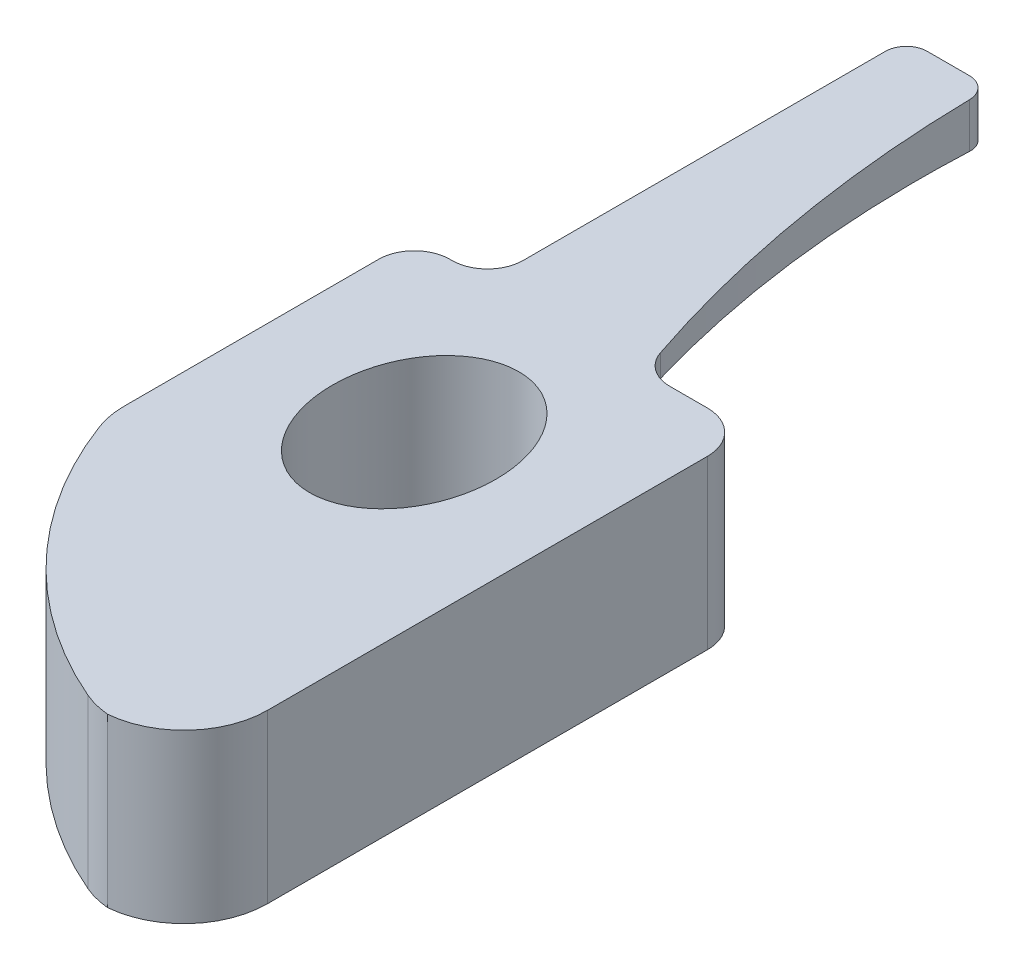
ISO-10303-21;
HEADER;
FILE_DESCRIPTION(('STEP AP214'),'2;1');
FILE_NAME('part.step','',(''),(''),'','','');
FILE_SCHEMA(('AUTOMOTIVE_DESIGN { 1 0 10303 214 1 1 1 1 }'));
ENDSEC;
DATA;
#1=APPLICATION_CONTEXT('core data for automotive mechanical design processes');
#2=APPLICATION_PROTOCOL_DEFINITION('international standard','automotive_design',2000,#1);
#3=PRODUCT_CONTEXT('',#1,'mechanical');
#4=PRODUCT('Part','Part','',(#3));
#5=PRODUCT_RELATED_PRODUCT_CATEGORY('part','',(#4));
#6=PRODUCT_DEFINITION_FORMATION('','',#4);
#7=PRODUCT_DEFINITION_CONTEXT('part definition',#1,'design');
#8=PRODUCT_DEFINITION('design','',#6,#7);
#9=PRODUCT_DEFINITION_SHAPE('','',#8);
#10=(LENGTH_UNIT() NAMED_UNIT(*) SI_UNIT(.MILLI.,.METRE.));
#11=(NAMED_UNIT(*) PLANE_ANGLE_UNIT() SI_UNIT($,.RADIAN.));
#12=(NAMED_UNIT(*) SI_UNIT($,.STERADIAN.) SOLID_ANGLE_UNIT());
#13=UNCERTAINTY_MEASURE_WITH_UNIT(LENGTH_MEASURE(1.E-05),#10,'distance_accuracy_value','');
#14=(GEOMETRIC_REPRESENTATION_CONTEXT(3) GLOBAL_UNCERTAINTY_ASSIGNED_CONTEXT((#13)) GLOBAL_UNIT_ASSIGNED_CONTEXT((#10,
#11,#12)) REPRESENTATION_CONTEXT('',''));
#15=CARTESIAN_POINT('',(0.,0.,0.));
#16=DIRECTION('',(0.,0.,1.));
#17=DIRECTION('',(1.,0.,0.));
#18=AXIS2_PLACEMENT_3D('',#15,#16,#17);
#19=CARTESIAN_POINT('',(-4.,4.,-4.));
#20=DIRECTION('',(0.,0.,1.));
#21=DIRECTION('',(1.,0.,0.));
#22=AXIS2_PLACEMENT_3D('',#19,#20,#21);
#23=PLANE('',#22);
#24=DIRECTION('',(1.,0.,0.));
#25=VECTOR('',#24,1.);
#26=CARTESIAN_POINT('',(4.,4.,-4.));
#27=LINE('',#26,#25);
#28=CARTESIAN_POINT('',(2.10338099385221,4.,-4.));
#29=VERTEX_POINT('',#28);
#30=CARTESIAN_POINT('',(3.,4.,-4.));
#31=VERTEX_POINT('',#30);
#32=EDGE_CURVE('E430',#29,#31,#27,.T.);
#33=ORIENTED_EDGE('',*,*,#32,.T.);
#34=DIRECTION('',(0.,-1.,0.));
#35=VECTOR('',#34,1.);
#36=CARTESIAN_POINT('',(3.,4.,-4.));
#37=LINE('',#36,#35);
#38=CARTESIAN_POINT('',(3.,0.,-4.));
#39=VERTEX_POINT('',#38);
#40=EDGE_CURVE('E292',#31,#39,#37,.T.);
#41=ORIENTED_EDGE('',*,*,#40,.T.);
#42=DIRECTION('',(-1.,0.,0.));
#43=VECTOR('',#42,1.);
#44=CARTESIAN_POINT('',(-4.,0.,-4.));
#45=LINE('',#44,#43);
#46=CARTESIAN_POINT('',(-3.15,0.,-4.));
#47=VERTEX_POINT('',#46);
#48=EDGE_CURVE('E383',#39,#47,#45,.T.);
#49=ORIENTED_EDGE('',*,*,#48,.T.);
#50=DIRECTION('',(0.,-1.,0.));
#51=VECTOR('',#50,1.);
#52=CARTESIAN_POINT('',(-3.15,4.,-4.));
#53=LINE('',#52,#51);
#54=CARTESIAN_POINT('',(-3.15,4.,-4.));
#55=VERTEX_POINT('',#54);
#56=EDGE_CURVE('E241',#47,#55,#53,.F.);
#57=ORIENTED_EDGE('',*,*,#56,.T.);
#58=DIRECTION('',(1.,0.,0.));
#59=VECTOR('',#58,1.);
#60=CARTESIAN_POINT('',(-4.,4.,-4.));
#61=LINE('',#60,#59);
#62=CARTESIAN_POINT('',(-3.1,4.,-4.));
#63=VERTEX_POINT('',#62);
#64=EDGE_CURVE('E444',#55,#63,#61,.T.);
#65=ORIENTED_EDGE('',*,*,#64,.T.);
#66=DIRECTION('',(0.,1.,0.));
#67=VECTOR('',#66,1.);
#68=CARTESIAN_POINT('',(-3.1,2.96910080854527,-4.));
#69=LINE('',#68,#67);
#70=CARTESIAN_POINT('',(-3.1,2.96910080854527,-4.));
#71=VERTEX_POINT('',#70);
#72=EDGE_CURVE('E237',#63,#71,#69,.F.);
#73=ORIENTED_EDGE('',*,*,#72,.T.);
#74=DIRECTION('',(-1.,0.,0.));
#75=VECTOR('',#74,1.);
#76=CARTESIAN_POINT('',(-4.,2.96910080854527,-4.));
#77=LINE('',#76,#75);
#78=CARTESIAN_POINT('',(2.10338099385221,2.96910080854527,-4.));
#79=VERTEX_POINT('',#78);
#80=EDGE_CURVE('E204',#71,#79,#77,.F.);
#81=ORIENTED_EDGE('',*,*,#80,.T.);
#82=DIRECTION('',(0.,-1.,0.));
#83=VECTOR('',#82,1.);
#84=CARTESIAN_POINT('',(2.10338099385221,4.,-4.));
#85=LINE('',#84,#83);
#86=EDGE_CURVE('E233',#79,#29,#85,.F.);
#87=ORIENTED_EDGE('',*,*,#86,.T.);
#88=EDGE_LOOP('',(#33,#41,#49,#57,#65,#73,#81,#87));
#89=FACE_BOUND('',#88,.T.);
#90=ADVANCED_FACE('F45',(#89),#23,.F.);
#91=CARTESIAN_POINT('',(5.5,4.,0.15));
#92=DIRECTION('',(0.,1.,0.));
#93=DIRECTION('',(0.,0.,1.));
#94=AXIS2_PLACEMENT_3D('',#91,#92,#93);
#95=PLANE('',#94);
#96=DIRECTION('',(0.,0.,1.));
#97=VECTOR('',#96,1.);
#98=CARTESIAN_POINT('',(-4.,4.,-4.));
#99=LINE('',#98,#97);
#100=CARTESIAN_POINT('',(-4.,4.,-3.15));
#101=VERTEX_POINT('',#100);
#102=CARTESIAN_POINT('',(-4.,4.,2.93388218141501));
#103=VERTEX_POINT('',#102);
#104=EDGE_CURVE('E348',#101,#103,#99,.T.);
#105=ORIENTED_EDGE('',*,*,#104,.T.);
#106=CARTESIAN_POINT('',(-2.,4.,2.93388218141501));
#107=DIRECTION('',(0.,1.,0.));
#108=DIRECTION('',(0.,0.,1.));
#109=AXIS2_PLACEMENT_3D('',#106,#107,#108);
#110=CIRCLE('',#109,2.);
#111=CARTESIAN_POINT('',(-3.875,4.,3.62985272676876));
#112=VERTEX_POINT('',#111);
#113=EDGE_CURVE('E55',#103,#112,#110,.T.);
#114=ORIENTED_EDGE('',*,*,#113,.T.);
#115=CARTESIAN_POINT('',(5.5,4.,0.15));
#116=DIRECTION('',(0.,1.,0.));
#117=DIRECTION('',(0.,0.,1.));
#118=AXIS2_PLACEMENT_3D('',#115,#116,#117);
#119=CIRCLE('',#118,10.);
#120=CARTESIAN_POINT('',(1.55160238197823,4.,9.3375));
#121=VERTEX_POINT('',#120);
#122=EDGE_CURVE('E339',#112,#121,#119,.T.);
#123=ORIENTED_EDGE('',*,*,#122,.T.);
#124=CARTESIAN_POINT('',(2.34128190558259,4.,7.5));
#125=DIRECTION('',(0.,1.,0.));
#126=DIRECTION('',(0.,0.,1.));
#127=AXIS2_PLACEMENT_3D('',#124,#125,#126);
#128=CIRCLE('',#127,2.);
#129=CARTESIAN_POINT('',(2.17064095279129,4.,9.49270711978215));
#130=VERTEX_POINT('',#129);
#131=EDGE_CURVE('E62',#121,#130,#128,.T.);
#132=ORIENTED_EDGE('',*,*,#131,.T.);
#133=CARTESIAN_POINT('',(2.,4.,7.5));
#134=DIRECTION('',(0.,1.,0.));
#135=DIRECTION('',(0.,0.,1.));
#136=AXIS2_PLACEMENT_3D('',#133,#134,#135);
#137=CIRCLE('',#136,2.);
#138=CARTESIAN_POINT('',(4.,4.,7.5));
#139=VERTEX_POINT('',#138);
#140=EDGE_CURVE('E67',#130,#139,#137,.T.);
#141=ORIENTED_EDGE('',*,*,#140,.T.);
#142=DIRECTION('',(0.,0.,-1.));
#143=VECTOR('',#142,1.);
#144=CARTESIAN_POINT('',(4.,4.,-4.));
#145=LINE('',#144,#143);
#146=CARTESIAN_POINT('',(4.,4.,-3.));
#147=VERTEX_POINT('',#146);
#148=EDGE_CURVE('E347',#139,#147,#145,.T.);
#149=ORIENTED_EDGE('',*,*,#148,.T.);
#150=CARTESIAN_POINT('',(3.,4.,-3.));
#151=DIRECTION('',(0.,1.,0.));
#152=DIRECTION('',(0.,0.,1.));
#153=AXIS2_PLACEMENT_3D('',#150,#151,#152);
#154=CIRCLE('',#153,1.);
#155=EDGE_CURVE('E360',#147,#31,#154,.T.);
#156=ORIENTED_EDGE('',*,*,#155,.T.);
#157=ORIENTED_EDGE('',*,*,#32,.F.);
#158=CARTESIAN_POINT('',(2.10338099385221,4.,-4.85));
#159=DIRECTION('',(0.,1.,0.));
#160=DIRECTION('',(0.,0.,1.));
#161=AXIS2_PLACEMENT_3D('',#158,#159,#160);
#162=CIRCLE('',#161,0.85);
#163=CARTESIAN_POINT('',(1.29806747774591,4.,-4.57802547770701));
#164=VERTEX_POINT('',#163);
#165=EDGE_CURVE('E415',#29,#164,#162,.F.);
#166=ORIENTED_EDGE('',*,*,#165,.T.);
#167=CARTESIAN_POINT('',(29.1964285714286,4.,-14.));
#168=DIRECTION('',(0.,1.,0.));
#169=DIRECTION('',(0.,0.,1.));
#170=AXIS2_PLACEMENT_3D('',#167,#168,#169);
#171=CIRCLE('',#170,29.4464285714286);
#172=CARTESIAN_POINT('',(-0.245895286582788,4.,-13.5083482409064));
#173=VERTEX_POINT('',#172);
#174=EDGE_CURVE('E436',#173,#164,#171,.T.);
#175=ORIENTED_EDGE('',*,*,#174,.F.);
#176=CARTESIAN_POINT('',(-0.745825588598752,4.,-13.5));
#177=DIRECTION('',(0.,1.,0.));
#178=DIRECTION('',(0.,0.,1.));
#179=AXIS2_PLACEMENT_3D('',#176,#177,#178);
#180=CIRCLE('',#179,0.5);
#181=CARTESIAN_POINT('',(-0.745825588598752,4.,-14.));
#182=VERTEX_POINT('',#181);
#183=EDGE_CURVE('E201',#173,#182,#180,.T.);
#184=ORIENTED_EDGE('',*,*,#183,.T.);
#185=DIRECTION('',(-1.,0.,0.));
#186=VECTOR('',#185,1.);
#187=CARTESIAN_POINT('',(14.0603180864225,4.,-14.));
#188=LINE('',#187,#186);
#189=CARTESIAN_POINT('',(-1.75,4.,-14.));
#190=VERTEX_POINT('',#189);
#191=EDGE_CURVE('E185',#182,#190,#188,.T.);
#192=ORIENTED_EDGE('',*,*,#191,.T.);
#193=CARTESIAN_POINT('',(-1.75,4.,-13.5));
#194=DIRECTION('',(0.,1.,0.));
#195=DIRECTION('',(0.,0.,1.));
#196=AXIS2_PLACEMENT_3D('',#193,#194,#195);
#197=CIRCLE('',#196,0.5);
#198=CARTESIAN_POINT('',(-2.25,4.,-13.5));
#199=VERTEX_POINT('',#198);
#200=EDGE_CURVE('E203',#190,#199,#197,.T.);
#201=ORIENTED_EDGE('',*,*,#200,.T.);
#202=DIRECTION('',(0.,0.,-1.));
#203=VECTOR('',#202,1.);
#204=CARTESIAN_POINT('',(-2.25,4.,-14.));
#205=LINE('',#204,#203);
#206=CARTESIAN_POINT('',(-2.25,4.,-4.85));
#207=VERTEX_POINT('',#206);
#208=EDGE_CURVE('E448',#207,#199,#205,.T.);
#209=ORIENTED_EDGE('',*,*,#208,.F.);
#210=CARTESIAN_POINT('',(-3.1,4.,-4.85));
#211=DIRECTION('',(0.,1.,0.));
#212=DIRECTION('',(0.,0.,1.));
#213=AXIS2_PLACEMENT_3D('',#210,#211,#212);
#214=CIRCLE('',#213,0.85);
#215=EDGE_CURVE('E253',#207,#63,#214,.F.);
#216=ORIENTED_EDGE('',*,*,#215,.T.);
#217=ORIENTED_EDGE('',*,*,#64,.F.);
#218=CARTESIAN_POINT('',(-3.15,4.,-3.15));
#219=DIRECTION('',(0.,1.,0.));
#220=DIRECTION('',(0.,0.,1.));
#221=AXIS2_PLACEMENT_3D('',#218,#219,#220);
#222=CIRCLE('',#221,0.85);
#223=EDGE_CURVE('E244',#55,#101,#222,.T.);
#224=ORIENTED_EDGE('',*,*,#223,.T.);
#225=EDGE_LOOP('',(#105,#114,#123,#132,#141,#149,#156,#157,#166,#175,#184,#192,#201,#209,#216,
#217,#224));
#226=FACE_BOUND('',#225,.T.);
#227=CARTESIAN_POINT('',(0.,4.,0.));
#228=DIRECTION('',(0.,1.,0.));
#229=DIRECTION('',(0.,0.,1.));
#230=AXIS2_PLACEMENT_3D('',#227,#228,#229);
#231=ELLIPSE('',#230,2.5,1.95);
#232=CARTESIAN_POINT('',(0.,4.,2.5));
#233=VERTEX_POINT('',#232);
#234=EDGE_CURVE('E399',#233,#233,#231,.T.);
#235=ORIENTED_EDGE('',*,*,#234,.F.);
#236=EDGE_LOOP('',(#235));
#237=FACE_BOUND('',#236,.T.);
#238=ADVANCED_FACE('F315',(#226,#237),#95,.T.);
#239=CARTESIAN_POINT('',(5.5,0.,0.15));
#240=DIRECTION('',(0.,1.,0.));
#241=DIRECTION('',(0.,0.,1.));
#242=AXIS2_PLACEMENT_3D('',#239,#240,#241);
#243=PLANE('',#242);
#244=CARTESIAN_POINT('',(5.5,0.,0.15));
#245=DIRECTION('',(0.,1.,0.));
#246=DIRECTION('',(0.,0.,1.));
#247=AXIS2_PLACEMENT_3D('',#244,#245,#246);
#248=CIRCLE('',#247,10.);
#249=CARTESIAN_POINT('',(-3.875,0.,3.62985272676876));
#250=VERTEX_POINT('',#249);
#251=CARTESIAN_POINT('',(1.55160238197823,0.,9.3375));
#252=VERTEX_POINT('',#251);
#253=EDGE_CURVE('E398',#250,#252,#248,.T.);
#254=ORIENTED_EDGE('',*,*,#253,.F.);
#255=CARTESIAN_POINT('',(-2.,0.,2.93388218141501));
#256=DIRECTION('',(0.,1.,0.));
#257=DIRECTION('',(0.,0.,1.));
#258=AXIS2_PLACEMENT_3D('',#255,#256,#257);
#259=CIRCLE('',#258,2.);
#260=CARTESIAN_POINT('',(-4.,0.,2.93388218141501));
#261=VERTEX_POINT('',#260);
#262=EDGE_CURVE('E352',#250,#261,#259,.F.);
#263=ORIENTED_EDGE('',*,*,#262,.T.);
#264=DIRECTION('',(0.,0.,1.));
#265=VECTOR('',#264,1.);
#266=CARTESIAN_POINT('',(-4.,0.,-4.));
#267=LINE('',#266,#265);
#268=CARTESIAN_POINT('',(-4.,0.,-3.15));
#269=VERTEX_POINT('',#268);
#270=EDGE_CURVE('E394',#269,#261,#267,.T.);
#271=ORIENTED_EDGE('',*,*,#270,.F.);
#272=CARTESIAN_POINT('',(-3.15,0.,-3.15));
#273=DIRECTION('',(0.,1.,0.));
#274=DIRECTION('',(0.,0.,1.));
#275=AXIS2_PLACEMENT_3D('',#272,#273,#274);
#276=CIRCLE('',#275,0.85);
#277=EDGE_CURVE('E229',#269,#47,#276,.F.);
#278=ORIENTED_EDGE('',*,*,#277,.T.);
#279=ORIENTED_EDGE('',*,*,#48,.F.);
#280=CARTESIAN_POINT('',(3.,0.,-3.));
#281=DIRECTION('',(0.,1.,0.));
#282=DIRECTION('',(0.,0.,1.));
#283=AXIS2_PLACEMENT_3D('',#280,#281,#282);
#284=CIRCLE('',#283,1.);
#285=CARTESIAN_POINT('',(4.,0.,-3.));
#286=VERTEX_POINT('',#285);
#287=EDGE_CURVE('E422',#39,#286,#284,.F.);
#288=ORIENTED_EDGE('',*,*,#287,.T.);
#289=DIRECTION('',(0.,0.,-1.));
#290=VECTOR('',#289,1.);
#291=CARTESIAN_POINT('',(4.,0.,-4.));
#292=LINE('',#291,#290);
#293=CARTESIAN_POINT('',(4.,0.,7.5));
#294=VERTEX_POINT('',#293);
#295=EDGE_CURVE('E386',#294,#286,#292,.T.);
#296=ORIENTED_EDGE('',*,*,#295,.F.);
#297=CARTESIAN_POINT('',(2.,0.,7.5));
#298=DIRECTION('',(0.,1.,0.));
#299=DIRECTION('',(0.,0.,1.));
#300=AXIS2_PLACEMENT_3D('',#297,#298,#299);
#301=CIRCLE('',#300,2.);
#302=CARTESIAN_POINT('',(2.17064095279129,0.,9.49270711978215));
#303=VERTEX_POINT('',#302);
#304=EDGE_CURVE('E358',#294,#303,#301,.F.);
#305=ORIENTED_EDGE('',*,*,#304,.T.);
#306=CARTESIAN_POINT('',(2.34128190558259,0.,7.5));
#307=DIRECTION('',(0.,1.,0.));
#308=DIRECTION('',(0.,0.,1.));
#309=AXIS2_PLACEMENT_3D('',#306,#307,#308);
#310=CIRCLE('',#309,2.);
#311=EDGE_CURVE('E354',#303,#252,#310,.F.);
#312=ORIENTED_EDGE('',*,*,#311,.T.);
#313=EDGE_LOOP('',(#254,#263,#271,#278,#279,#288,#296,#305,#312));
#314=FACE_BOUND('',#313,.T.);
#315=CARTESIAN_POINT('',(0.,0.,0.));
#316=DIRECTION('',(0.,1.,0.));
#317=DIRECTION('',(0.,0.,1.));
#318=AXIS2_PLACEMENT_3D('',#315,#316,#317);
#319=ELLIPSE('',#318,2.5,1.95);
#320=CARTESIAN_POINT('',(0.,0.,2.5));
#321=VERTEX_POINT('',#320);
#322=EDGE_CURVE('E389',#321,#321,#319,.T.);
#323=ORIENTED_EDGE('',*,*,#322,.T.);
#324=EDGE_LOOP('',(#323));
#325=FACE_BOUND('',#324,.T.);
#326=ADVANCED_FACE('F321',(#314,#325),#243,.F.);
#327=CARTESIAN_POINT('',(-4.,4.,-4.));
#328=DIRECTION('',(1.,0.,0.));
#329=DIRECTION('',(0.,0.,-1.));
#330=AXIS2_PLACEMENT_3D('',#327,#328,#329);
#331=PLANE('',#330);
#332=ORIENTED_EDGE('',*,*,#270,.T.);
#333=DIRECTION('',(0.,-1.,0.));
#334=VECTOR('',#333,1.);
#335=CARTESIAN_POINT('',(-4.,4.,2.93388218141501));
#336=LINE('',#335,#334);
#337=EDGE_CURVE('E368',#261,#103,#336,.F.);
#338=ORIENTED_EDGE('',*,*,#337,.T.);
#339=ORIENTED_EDGE('',*,*,#104,.F.);
#340=DIRECTION('',(0.,-1.,0.));
#341=VECTOR('',#340,1.);
#342=CARTESIAN_POINT('',(-4.,4.,-3.15));
#343=LINE('',#342,#341);
#344=EDGE_CURVE('E225',#101,#269,#343,.T.);
#345=ORIENTED_EDGE('',*,*,#344,.T.);
#346=EDGE_LOOP('',(#332,#338,#339,#345));
#347=FACE_BOUND('',#346,.T.);
#348=ADVANCED_FACE('F278',(#347),#331,.F.);
#349=CARTESIAN_POINT('',(5.5,4.,0.15));
#350=DIRECTION('',(0.,-1.,0.));
#351=DIRECTION('',(0.,0.,-1.));
#352=AXIS2_PLACEMENT_3D('',#349,#350,#351);
#353=CYLINDRICAL_SURFACE('',#352,10.);
#354=ORIENTED_EDGE('',*,*,#122,.F.);
#355=DIRECTION('',(0.,-1.,0.));
#356=VECTOR('',#355,1.);
#357=CARTESIAN_POINT('',(-3.875,4.,3.62985272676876));
#358=LINE('',#357,#356);
#359=EDGE_CURVE('E342',#112,#250,#358,.T.);
#360=ORIENTED_EDGE('',*,*,#359,.T.);
#361=ORIENTED_EDGE('',*,*,#253,.T.);
#362=DIRECTION('',(0.,-1.,0.));
#363=VECTOR('',#362,1.);
#364=CARTESIAN_POINT('',(1.55160238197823,4.,9.3375));
#365=LINE('',#364,#363);
#366=EDGE_CURVE('E345',#252,#121,#365,.F.);
#367=ORIENTED_EDGE('',*,*,#366,.T.);
#368=EDGE_LOOP('',(#354,#360,#361,#367));
#369=FACE_BOUND('',#368,.T.);
#370=ADVANCED_FACE('F329',(#369),#353,.T.);
#371=CARTESIAN_POINT('',(4.,4.,-4.));
#372=DIRECTION('',(-1.,0.,0.));
#373=DIRECTION('',(0.,0.,1.));
#374=AXIS2_PLACEMENT_3D('',#371,#372,#373);
#375=PLANE('',#374);
#376=ORIENTED_EDGE('',*,*,#148,.F.);
#377=DIRECTION('',(0.,-1.,0.));
#378=VECTOR('',#377,1.);
#379=CARTESIAN_POINT('',(4.,4.,7.5));
#380=LINE('',#379,#378);
#381=EDGE_CURVE('E11',#139,#294,#380,.T.);
#382=ORIENTED_EDGE('',*,*,#381,.T.);
#383=ORIENTED_EDGE('',*,*,#295,.T.);
#384=DIRECTION('',(0.,-1.,0.));
#385=VECTOR('',#384,1.);
#386=CARTESIAN_POINT('',(4.,4.,-3.));
#387=LINE('',#386,#385);
#388=EDGE_CURVE('E425',#286,#147,#387,.F.);
#389=ORIENTED_EDGE('',*,*,#388,.T.);
#390=EDGE_LOOP('',(#376,#382,#383,#389));
#391=FACE_BOUND('',#390,.T.);
#392=ADVANCED_FACE('F326',(#391),#375,.F.);
#393=DIRECTION('',(0.,-1.,0.));
#394=VECTOR('',#393,1.);
#395=SURFACE_OF_LINEAR_EXTRUSION('',#231,#394);
#396=ORIENTED_EDGE('',*,*,#234,.T.);
#397=EDGE_LOOP('',(#396));
#398=FACE_BOUND('',#397,.T.);
#399=ORIENTED_EDGE('',*,*,#322,.F.);
#400=EDGE_LOOP('',(#399));
#401=FACE_BOUND('',#400,.T.);
#402=ADVANCED_FACE('F328',(#398,#401),#395,.T.);
#403=CARTESIAN_POINT('',(14.0603180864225,2.9,-14.));
#404=DIRECTION('',(0.,-0.998204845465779,0.0598922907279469));
#405=DIRECTION('',(0.,-0.0598922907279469,-0.998204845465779));
#406=AXIS2_PLACEMENT_3D('',#403,#404,#405);
#407=PLANE('',#406);
#408=CARTESIAN_POINT('',(29.1964285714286,2.9,-14.));
#409=DIRECTION('',(0.,-0.998204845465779,0.0598922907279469));
#410=DIRECTION('',(0.,0.0598922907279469,0.998204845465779));
#411=AXIS2_PLACEMENT_3D('',#408,#409,#410);
#412=ELLIPSE('',#411,29.4993845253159,29.4464285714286);
#413=CARTESIAN_POINT('',(1.29806747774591,3.46531847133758,-4.57802547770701));
#414=VERTEX_POINT('',#413);
#415=CARTESIAN_POINT('',(-0.245895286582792,2.92949910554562,-13.5083482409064));
#416=VERTEX_POINT('',#415);
#417=EDGE_CURVE('E172',#414,#416,#412,.T.);
#418=ORIENTED_EDGE('',*,*,#417,.F.);
#419=CARTESIAN_POINT('',(2.10338099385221,3.449,-4.85));
#420=DIRECTION('',(0.,-0.998204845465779,0.0598922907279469));
#421=DIRECTION('',(0.,0.0598922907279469,0.998204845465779));
#422=AXIS2_PLACEMENT_3D('',#419,#420,#421);
#423=ELLIPSE('',#422,0.851528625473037,0.85);
#424=CARTESIAN_POINT('',(1.31593859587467,3.46820323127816,-4.52994614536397));
#425=VERTEX_POINT('',#424);
#426=EDGE_CURVE('E293',#414,#425,#423,.F.);
#427=ORIENTED_EDGE('',*,*,#426,.T.);
#428=DIRECTION('',(-1.,0.,0.));
#429=VECTOR('',#428,1.);
#430=CARTESIAN_POINT('',(14.0603180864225,3.46820323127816,-4.52994614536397));
#431=LINE('',#430,#429);
#432=CARTESIAN_POINT('',(-2.31255760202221,3.46820323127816,-4.52994614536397));
#433=VERTEX_POINT('',#432);
#434=EDGE_CURVE('E197',#425,#433,#431,.T.);
#435=ORIENTED_EDGE('',*,*,#434,.T.);
#436=CARTESIAN_POINT('',(-3.1,3.449,-4.85));
#437=DIRECTION('',(0.,-0.998204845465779,0.0598922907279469));
#438=DIRECTION('',(0.,-0.0598922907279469,-0.998204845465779));
#439=AXIS2_PLACEMENT_3D('',#436,#437,#438);
#440=ELLIPSE('',#439,0.851528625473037,0.85);
#441=CARTESIAN_POINT('',(-2.25,3.449,-4.85));
#442=VERTEX_POINT('',#441);
#443=EDGE_CURVE('E266',#433,#442,#440,.F.);
#444=ORIENTED_EDGE('',*,*,#443,.T.);
#445=DIRECTION('',(0.,0.0598922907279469,0.998204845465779));
#446=VECTOR('',#445,1.);
#447=CARTESIAN_POINT('',(-2.25,2.9,-14.));
#448=LINE('',#447,#446);
#449=CARTESIAN_POINT('',(-2.25,2.93,-13.5));
#450=VERTEX_POINT('',#449);
#451=EDGE_CURVE('E186',#450,#442,#448,.T.);
#452=ORIENTED_EDGE('',*,*,#451,.F.);
#453=CARTESIAN_POINT('',(-1.75,2.93,-13.5));
#454=DIRECTION('',(0.,-0.998204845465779,0.0598922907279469));
#455=DIRECTION('',(0.,0.0598922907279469,0.998204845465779));
#456=AXIS2_PLACEMENT_3D('',#453,#454,#455);
#457=ELLIPSE('',#456,0.500899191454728,0.5);
#458=CARTESIAN_POINT('',(-1.75,2.9,-14.));
#459=VERTEX_POINT('',#458);
#460=EDGE_CURVE('E198',#450,#459,#457,.T.);
#461=ORIENTED_EDGE('',*,*,#460,.T.);
#462=DIRECTION('',(-1.,0.,0.));
#463=VECTOR('',#462,1.);
#464=CARTESIAN_POINT('',(14.0603180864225,2.9,-14.));
#465=LINE('',#464,#463);
#466=CARTESIAN_POINT('',(-0.745825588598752,2.9,-14.));
#467=VERTEX_POINT('',#466);
#468=EDGE_CURVE('E193',#467,#459,#465,.T.);
#469=ORIENTED_EDGE('',*,*,#468,.F.);
#470=CARTESIAN_POINT('',(-0.745825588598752,2.93,-13.5));
#471=DIRECTION('',(0.,-0.998204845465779,0.0598922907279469));
#472=DIRECTION('',(0.,0.0598922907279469,0.998204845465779));
#473=AXIS2_PLACEMENT_3D('',#470,#471,#472);
#474=ELLIPSE('',#473,0.500899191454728,0.5);
#475=EDGE_CURVE('E190',#467,#416,#474,.T.);
#476=ORIENTED_EDGE('',*,*,#475,.T.);
#477=EDGE_LOOP('',(#418,#427,#435,#444,#452,#461,#469,#476));
#478=FACE_BOUND('',#477,.T.);
#479=ADVANCED_FACE('F191',(#478),#407,.T.);
#480=CARTESIAN_POINT('',(14.0603180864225,4.,-14.));
#481=DIRECTION('',(0.,0.,-1.));
#482=DIRECTION('',(-1.,0.,0.));
#483=AXIS2_PLACEMENT_3D('',#480,#481,#482);
#484=PLANE('',#483);
#485=ORIENTED_EDGE('',*,*,#191,.F.);
#486=DIRECTION('',(0.,-1.,0.));
#487=VECTOR('',#486,1.);
#488=CARTESIAN_POINT('',(-0.745825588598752,2.9,-14.));
#489=LINE('',#488,#487);
#490=EDGE_CURVE('E218',#182,#467,#489,.T.);
#491=ORIENTED_EDGE('',*,*,#490,.T.);
#492=ORIENTED_EDGE('',*,*,#468,.T.);
#493=DIRECTION('',(0.,-1.,0.));
#494=VECTOR('',#493,1.);
#495=CARTESIAN_POINT('',(-1.75,4.,-14.));
#496=LINE('',#495,#494);
#497=EDGE_CURVE('E215',#459,#190,#496,.F.);
#498=ORIENTED_EDGE('',*,*,#497,.T.);
#499=EDGE_LOOP('',(#485,#491,#492,#498));
#500=FACE_BOUND('',#499,.T.);
#501=ADVANCED_FACE('F473',(#500),#484,.T.);
#502=CARTESIAN_POINT('',(-2.25,0.,-14.));
#503=DIRECTION('',(1.,0.,0.));
#504=DIRECTION('',(0.,0.,-1.));
#505=AXIS2_PLACEMENT_3D('',#502,#503,#504);
#506=PLANE('',#505);
#507=ORIENTED_EDGE('',*,*,#451,.T.);
#508=DIRECTION('',(0.,1.,0.));
#509=VECTOR('',#508,1.);
#510=CARTESIAN_POINT('',(-2.25,4.,-4.85));
#511=LINE('',#510,#509);
#512=EDGE_CURVE('E247',#442,#207,#511,.T.);
#513=ORIENTED_EDGE('',*,*,#512,.T.);
#514=ORIENTED_EDGE('',*,*,#208,.T.);
#515=DIRECTION('',(0.,-1.,0.));
#516=VECTOR('',#515,1.);
#517=CARTESIAN_POINT('',(-2.25,2.9,-13.5));
#518=LINE('',#517,#516);
#519=EDGE_CURVE('E221',#199,#450,#518,.T.);
#520=ORIENTED_EDGE('',*,*,#519,.T.);
#521=EDGE_LOOP('',(#507,#513,#514,#520));
#522=FACE_BOUND('',#521,.T.);
#523=ADVANCED_FACE('F476',(#522),#506,.F.);
#524=CARTESIAN_POINT('',(29.1964285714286,0.,-14.));
#525=DIRECTION('',(0.,1.,0.));
#526=DIRECTION('',(0.,0.,1.));
#527=AXIS2_PLACEMENT_3D('',#524,#525,#526);
#528=CYLINDRICAL_SURFACE('',#527,29.4464285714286);
#529=ORIENTED_EDGE('',*,*,#174,.T.);
#530=DIRECTION('',(0.,1.,0.));
#531=VECTOR('',#530,1.);
#532=CARTESIAN_POINT('',(1.29806747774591,0.,-4.57802547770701));
#533=LINE('',#532,#531);
#534=EDGE_CURVE('E180',#164,#414,#533,.F.);
#535=ORIENTED_EDGE('',*,*,#534,.T.);
#536=ORIENTED_EDGE('',*,*,#417,.T.);
#537=DIRECTION('',(0.,1.,0.));
#538=VECTOR('',#537,1.);
#539=CARTESIAN_POINT('',(-0.245895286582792,0.,-13.5083482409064));
#540=LINE('',#539,#538);
#541=EDGE_CURVE('E177',#416,#173,#540,.T.);
#542=ORIENTED_EDGE('',*,*,#541,.T.);
#543=EDGE_LOOP('',(#529,#535,#536,#542));
#544=FACE_BOUND('',#543,.T.);
#545=ADVANCED_FACE('F175',(#544),#528,.F.);
#546=CARTESIAN_POINT('',(14.0603180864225,2.96910080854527,-4.5));
#547=DIRECTION('',(-1.,0.,0.));
#548=DIRECTION('',(0.,-1.,0.));
#549=AXIS2_PLACEMENT_3D('',#546,#547,#548);
#550=CYLINDRICAL_SURFACE('',#549,0.5);
#551=ORIENTED_EDGE('',*,*,#434,.F.);
#552=CARTESIAN_POINT('',(1.31593859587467,3.46820323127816,-4.52994614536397));
#553=CARTESIAN_POINT('',(1.32773211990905,3.46996000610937,-4.50082172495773));
#554=CARTESIAN_POINT('',(1.34120981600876,3.46910496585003,-4.47239103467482));
#555=CARTESIAN_POINT('',(1.37082543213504,3.46304931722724,-4.41779882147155));
#556=CARTESIAN_POINT('',(1.3869346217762,3.45789341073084,-4.39161699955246));
#557=CARTESIAN_POINT('',(1.42552688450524,3.44245202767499,-4.33576643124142));
#558=CARTESIAN_POINT('',(1.44860983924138,3.43122867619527,-4.30678183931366));
#559=CARTESIAN_POINT('',(1.49732033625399,3.4048195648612,-4.25290978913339));
#560=CARTESIAN_POINT('',(1.52295895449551,3.38961604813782,-4.22804152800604));
#561=CARTESIAN_POINT('',(1.58649154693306,3.34978749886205,-4.1734596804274));
#562=CARTESIAN_POINT('',(1.62522465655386,3.3238135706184,-4.14571497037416));
#563=CARTESIAN_POINT('',(1.70479946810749,3.26840616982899,-4.09780614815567));
#564=CARTESIAN_POINT('',(1.74564410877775,3.23896779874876,-4.07765294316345));
#565=CARTESIAN_POINT('',(1.8379129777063,3.17114337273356,-4.04066539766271));
#566=CARTESIAN_POINT('',(1.88965273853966,3.13223281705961,-4.02559346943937));
#567=CARTESIAN_POINT('',(1.99386892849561,3.05308275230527,-4.00542009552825));
#568=CARTESIAN_POINT('',(2.0463435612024,3.01284623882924,-4.00029755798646));
#569=CARTESIAN_POINT('',(2.10029650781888,2.97146650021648,-4.00000420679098));
#570=CARTESIAN_POINT('',(2.10183878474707,2.97028362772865,-4.0000000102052));
#571=CARTESIAN_POINT('',(2.10338099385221,2.96910080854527,-4.));
#572=B_SPLINE_CURVE_WITH_KNOTS('',3,(#552,#553,#554,#555,#556,#557,#558,#559,#560,#561,#562,
#563,#564,#565,#566,#567,#568,#569,#570,#571),.UNSPECIFIED.,.F.,.F.,(4,2,2,2,2,2,2,2,2,4),(0.,
0.0940249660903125,0.18708466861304,0.302610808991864,0.418661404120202,0.580573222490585,
0.742716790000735,0.9412825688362,1.139426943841,1.14525790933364),.UNSPECIFIED.);
#573=EDGE_CURVE('E283',#425,#79,#572,.T.);
#574=ORIENTED_EDGE('',*,*,#573,.T.);
#575=ORIENTED_EDGE('',*,*,#80,.F.);
#576=CARTESIAN_POINT('',(-2.31255760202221,3.46820323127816,-4.52994614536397));
#577=CARTESIAN_POINT('',(-2.32435112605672,3.46996000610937,-4.50082172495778));
#578=CARTESIAN_POINT('',(-2.33782882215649,3.46910496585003,-4.47239103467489));
#579=CARTESIAN_POINT('',(-2.36744443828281,3.46304931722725,-4.41779882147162));
#580=CARTESIAN_POINT('',(-2.38355362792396,3.45789341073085,-4.39161699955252));
#581=CARTESIAN_POINT('',(-2.42214589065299,3.44245202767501,-4.33576643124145));
#582=CARTESIAN_POINT('',(-2.44522884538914,3.43122867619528,-4.3067818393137));
#583=CARTESIAN_POINT('',(-2.49393934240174,3.40481956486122,-4.25290978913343));
#584=CARTESIAN_POINT('',(-2.51957796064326,3.38961604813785,-4.22804152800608));
#585=CARTESIAN_POINT('',(-2.5831105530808,3.34978749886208,-4.17345968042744));
#586=CARTESIAN_POINT('',(-2.62184366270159,3.32381357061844,-4.1457149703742));
#587=CARTESIAN_POINT('',(-2.70141847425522,3.26840616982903,-4.0978061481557));
#588=CARTESIAN_POINT('',(-2.74226311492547,3.2389677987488,-4.07765294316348));
#589=CARTESIAN_POINT('',(-2.83453198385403,3.17114337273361,-4.04066539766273));
#590=CARTESIAN_POINT('',(-2.88627174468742,3.13223281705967,-4.02559346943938));
#591=CARTESIAN_POINT('',(-2.99048793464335,3.05308275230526,-4.00542009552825));
#592=CARTESIAN_POINT('',(-3.0429625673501,3.01284623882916,-4.00029755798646));
#593=CARTESIAN_POINT('',(-3.09691551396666,2.97146650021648,-4.00000420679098));
#594=CARTESIAN_POINT('',(-3.09845779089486,2.97028362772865,-4.0000000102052));
#595=CARTESIAN_POINT('',(-3.1,2.96910080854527,-4.));
#596=B_SPLINE_CURVE_WITH_KNOTS('',3,(#576,#577,#578,#579,#580,#581,#582,#583,#584,#585,#586,
#587,#588,#589,#590,#591,#592,#593,#594,#595),.UNSPECIFIED.,.F.,.F.,(4,2,2,2,2,2,2,2,2,4),(0.,
0.0940249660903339,0.187084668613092,0.302610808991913,0.418661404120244,0.580573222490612,
0.742716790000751,0.94128256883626,1.1394269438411,1.14525790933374),.UNSPECIFIED.);
#597=EDGE_CURVE('E256',#71,#433,#596,.F.);
#598=ORIENTED_EDGE('',*,*,#597,.T.);
#599=EDGE_LOOP('',(#551,#574,#575,#598));
#600=FACE_BOUND('',#599,.T.);
#601=ADVANCED_FACE('F272',(#600),#550,.F.);
#602=CARTESIAN_POINT('',(-0.745825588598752,0.,-13.5));
#603=DIRECTION('',(0.,1.,0.));
#604=DIRECTION('',(0.,0.,1.));
#605=AXIS2_PLACEMENT_3D('',#602,#603,#604);
#606=CYLINDRICAL_SURFACE('',#605,0.5);
#607=ORIENTED_EDGE('',*,*,#475,.F.);
#608=ORIENTED_EDGE('',*,*,#490,.F.);
#609=ORIENTED_EDGE('',*,*,#183,.F.);
#610=ORIENTED_EDGE('',*,*,#541,.F.);
#611=EDGE_LOOP('',(#607,#608,#609,#610));
#612=FACE_BOUND('',#611,.T.);
#613=ADVANCED_FACE('F200',(#612),#606,.T.);
#614=CARTESIAN_POINT('',(-1.75,0.,-13.5));
#615=DIRECTION('',(0.,1.,0.));
#616=DIRECTION('',(0.,0.,1.));
#617=AXIS2_PLACEMENT_3D('',#614,#615,#616);
#618=CYLINDRICAL_SURFACE('',#617,0.5);
#619=ORIENTED_EDGE('',*,*,#200,.F.);
#620=ORIENTED_EDGE('',*,*,#497,.F.);
#621=ORIENTED_EDGE('',*,*,#460,.F.);
#622=ORIENTED_EDGE('',*,*,#519,.F.);
#623=EDGE_LOOP('',(#619,#620,#621,#622));
#624=FACE_BOUND('',#623,.T.);
#625=ADVANCED_FACE('F500',(#624),#618,.T.);
#626=CARTESIAN_POINT('',(-3.15,4.,-3.15));
#627=DIRECTION('',(0.,-1.,0.));
#628=DIRECTION('',(0.,0.,-1.));
#629=AXIS2_PLACEMENT_3D('',#626,#627,#628);
#630=CYLINDRICAL_SURFACE('',#629,0.85);
#631=ORIENTED_EDGE('',*,*,#223,.F.);
#632=ORIENTED_EDGE('',*,*,#56,.F.);
#633=ORIENTED_EDGE('',*,*,#277,.F.);
#634=ORIENTED_EDGE('',*,*,#344,.F.);
#635=EDGE_LOOP('',(#631,#632,#633,#634));
#636=FACE_BOUND('',#635,.T.);
#637=ADVANCED_FACE('F450',(#636),#630,.T.);
#638=CARTESIAN_POINT('',(-3.1,0.,-4.85));
#639=DIRECTION('',(0.,-1.,0.));
#640=DIRECTION('',(0.,0.,-1.));
#641=AXIS2_PLACEMENT_3D('',#638,#639,#640);
#642=CYLINDRICAL_SURFACE('',#641,0.85);
#643=ORIENTED_EDGE('',*,*,#597,.F.);
#644=ORIENTED_EDGE('',*,*,#72,.F.);
#645=ORIENTED_EDGE('',*,*,#215,.F.);
#646=ORIENTED_EDGE('',*,*,#512,.F.);
#647=ORIENTED_EDGE('',*,*,#443,.F.);
#648=EDGE_LOOP('',(#643,#644,#645,#646,#647));
#649=FACE_BOUND('',#648,.T.);
#650=ADVANCED_FACE('F268',(#649),#642,.F.);
#651=CARTESIAN_POINT('',(2.10338099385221,0.,-4.85));
#652=DIRECTION('',(0.,1.,0.));
#653=DIRECTION('',(0.,0.,1.));
#654=AXIS2_PLACEMENT_3D('',#651,#652,#653);
#655=CYLINDRICAL_SURFACE('',#654,0.85);
#656=ORIENTED_EDGE('',*,*,#426,.F.);
#657=ORIENTED_EDGE('',*,*,#534,.F.);
#658=ORIENTED_EDGE('',*,*,#165,.F.);
#659=ORIENTED_EDGE('',*,*,#86,.F.);
#660=ORIENTED_EDGE('',*,*,#573,.F.);
#661=EDGE_LOOP('',(#656,#657,#658,#659,#660));
#662=FACE_BOUND('',#661,.T.);
#663=ADVANCED_FACE('F295',(#662),#655,.F.);
#664=CARTESIAN_POINT('',(3.,4.,-3.));
#665=DIRECTION('',(0.,-1.,0.));
#666=DIRECTION('',(0.,0.,-1.));
#667=AXIS2_PLACEMENT_3D('',#664,#665,#666);
#668=CYLINDRICAL_SURFACE('',#667,1.);
#669=ORIENTED_EDGE('',*,*,#155,.F.);
#670=ORIENTED_EDGE('',*,*,#388,.F.);
#671=ORIENTED_EDGE('',*,*,#287,.F.);
#672=ORIENTED_EDGE('',*,*,#40,.F.);
#673=EDGE_LOOP('',(#669,#670,#671,#672));
#674=FACE_BOUND('',#673,.T.);
#675=ADVANCED_FACE('F299',(#674),#668,.T.);
#676=CARTESIAN_POINT('',(-2.,4.,2.93388218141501));
#677=DIRECTION('',(0.,-1.,0.));
#678=DIRECTION('',(0.,0.,-1.));
#679=AXIS2_PLACEMENT_3D('',#676,#677,#678);
#680=CYLINDRICAL_SURFACE('',#679,2.);
#681=ORIENTED_EDGE('',*,*,#113,.F.);
#682=ORIENTED_EDGE('',*,*,#337,.F.);
#683=ORIENTED_EDGE('',*,*,#262,.F.);
#684=ORIENTED_EDGE('',*,*,#359,.F.);
#685=EDGE_LOOP('',(#681,#682,#683,#684));
#686=FACE_BOUND('',#685,.T.);
#687=ADVANCED_FACE('F303',(#686),#680,.T.);
#688=CARTESIAN_POINT('',(2.34128190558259,4.,7.5));
#689=DIRECTION('',(0.,-1.,0.));
#690=DIRECTION('',(0.,0.,-1.));
#691=AXIS2_PLACEMENT_3D('',#688,#689,#690);
#692=CYLINDRICAL_SURFACE('',#691,2.);
#693=DIRECTION('',(0.,-1.,0.));
#694=VECTOR('',#693,1.);
#695=CARTESIAN_POINT('',(2.17064095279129,2.,9.49270711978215));
#696=LINE('',#695,#694);
#697=EDGE_CURVE('E49',#130,#303,#696,.T.);
#698=ORIENTED_EDGE('',*,*,#697,.F.);
#699=ORIENTED_EDGE('',*,*,#131,.F.);
#700=ORIENTED_EDGE('',*,*,#366,.F.);
#701=ORIENTED_EDGE('',*,*,#311,.F.);
#702=EDGE_LOOP('',(#698,#699,#700,#701));
#703=FACE_BOUND('',#702,.T.);
#704=ADVANCED_FACE('F47',(#703),#692,.T.);
#705=CARTESIAN_POINT('',(2.,4.,7.5));
#706=DIRECTION('',(0.,-1.,0.));
#707=DIRECTION('',(0.,0.,-1.));
#708=AXIS2_PLACEMENT_3D('',#705,#706,#707);
#709=CYLINDRICAL_SURFACE('',#708,2.);
#710=ORIENTED_EDGE('',*,*,#140,.F.);
#711=ORIENTED_EDGE('',*,*,#697,.T.);
#712=ORIENTED_EDGE('',*,*,#304,.F.);
#713=ORIENTED_EDGE('',*,*,#381,.F.);
#714=EDGE_LOOP('',(#710,#711,#712,#713));
#715=FACE_BOUND('',#714,.T.);
#716=ADVANCED_FACE('F307',(#715),#709,.T.);
#717=CLOSED_SHELL('',(#90,#238,#326,#348,#370,#392,#402,#479,#501,#523,#545,#601,#613,#625,#637,
#650,#663,#675,#687,#704,#716));
#718=MANIFOLD_SOLID_BREP('B2',#717);
#719=ADVANCED_BREP_SHAPE_REPRESENTATION('',(#18,#718),#14);
#720=SHAPE_DEFINITION_REPRESENTATION(#9,#719);
ENDSEC;
END-ISO-10303-21;
